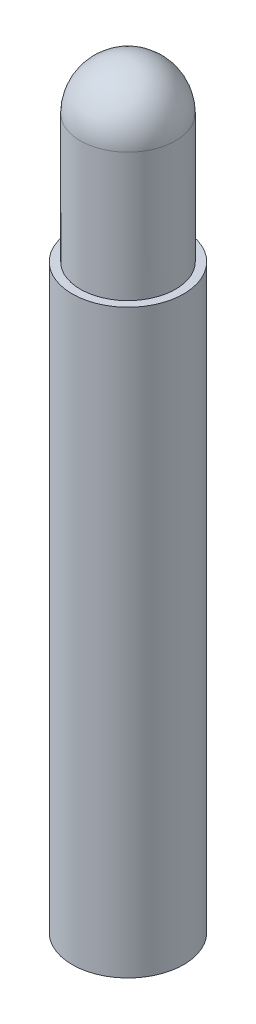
ISO-10303-21;
HEADER;
FILE_DESCRIPTION(('STEP AP214'),'2;1');
FILE_NAME('part.step','',(''),(''),'','','');
FILE_SCHEMA(('AUTOMOTIVE_DESIGN { 1 0 10303 214 1 1 1 1 }'));
ENDSEC;
DATA;
#1=APPLICATION_CONTEXT('core data for automotive mechanical design processes');
#2=APPLICATION_PROTOCOL_DEFINITION('international standard','automotive_design',2000,#1);
#3=PRODUCT_CONTEXT('',#1,'mechanical');
#4=PRODUCT('Part','Part','',(#3));
#5=PRODUCT_RELATED_PRODUCT_CATEGORY('part','',(#4));
#6=PRODUCT_DEFINITION_FORMATION('','',#4);
#7=PRODUCT_DEFINITION_CONTEXT('part definition',#1,'design');
#8=PRODUCT_DEFINITION('design','',#6,#7);
#9=PRODUCT_DEFINITION_SHAPE('','',#8);
#10=(LENGTH_UNIT() NAMED_UNIT(*) SI_UNIT(.MILLI.,.METRE.));
#11=(NAMED_UNIT(*) PLANE_ANGLE_UNIT() SI_UNIT($,.RADIAN.));
#12=(NAMED_UNIT(*) SI_UNIT($,.STERADIAN.) SOLID_ANGLE_UNIT());
#13=UNCERTAINTY_MEASURE_WITH_UNIT(LENGTH_MEASURE(1.E-05),#10,'distance_accuracy_value','');
#14=(GEOMETRIC_REPRESENTATION_CONTEXT(3) GLOBAL_UNCERTAINTY_ASSIGNED_CONTEXT((#13)) GLOBAL_UNIT_ASSIGNED_CONTEXT((#10,
#11,#12)) REPRESENTATION_CONTEXT('',''));
#15=CARTESIAN_POINT('',(0.,0.,0.));
#16=DIRECTION('',(0.,0.,1.));
#17=DIRECTION('',(1.,0.,0.));
#18=AXIS2_PLACEMENT_3D('',#15,#16,#17);
#19=CARTESIAN_POINT('',(0.,-31.2499999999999,0.));
#20=DIRECTION('',(0.,1.,0.));
#21=DIRECTION('',(-0.999589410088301,0.,-0.028653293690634));
#22=AXIS2_PLACEMENT_3D('',#19,#20,#21);
#23=CYLINDRICAL_SURFACE('',#22,5.85);
#24=CARTESIAN_POINT('',(0.,-31.2499999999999,0.));
#25=DIRECTION('',(0.,-1.,0.));
#26=DIRECTION('',(0.999589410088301,0.,0.028653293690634));
#27=AXIS2_PLACEMENT_3D('',#24,#25,#26);
#28=CIRCLE('',#27,5.85);
#29=CARTESIAN_POINT('',(-5.84759804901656,-31.2499999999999,-0.167621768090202));
#30=VERTEX_POINT('',#29);
#31=EDGE_CURVE('E9',#30,#30,#28,.T.);
#32=CARTESIAN_POINT('',(0.,29.7500000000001,0.));
#33=DIRECTION('',(0.,-1.,0.));
#34=DIRECTION('',(0.999589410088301,0.,0.028653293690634));
#35=AXIS2_PLACEMENT_3D('',#32,#33,#34);
#36=CIRCLE('',#35,5.85);
#37=CARTESIAN_POINT('',(-5.84759804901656,29.7500000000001,-0.167621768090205));
#38=VERTEX_POINT('',#37);
#39=EDGE_CURVE('E19',#38,#38,#36,.T.);
#40=CARTESIAN_POINT('',(-5.84759804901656,-31.2499999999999,-0.167621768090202));
#41=CARTESIAN_POINT('',(-5.84759804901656,-30.6145833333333,-0.167621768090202));
#42=CARTESIAN_POINT('',(-5.84759804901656,-29.9791666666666,-0.167621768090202));
#43=CARTESIAN_POINT('',(-5.84759804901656,-28.7083333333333,-0.167621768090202));
#44=CARTESIAN_POINT('',(-5.84759804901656,-28.0729166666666,-0.167621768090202));
#45=CARTESIAN_POINT('',(-5.84759804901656,-26.8020833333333,-0.167621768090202));
#46=CARTESIAN_POINT('',(-5.84759804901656,-26.1666666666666,-0.167621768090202));
#47=CARTESIAN_POINT('',(-5.84759804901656,-24.8958333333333,-0.167621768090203));
#48=CARTESIAN_POINT('',(-5.84759804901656,-24.2604166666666,-0.167621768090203));
#49=CARTESIAN_POINT('',(-5.84759804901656,-22.9895833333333,-0.167621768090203));
#50=CARTESIAN_POINT('',(-5.84759804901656,-22.3541666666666,-0.167621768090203));
#51=CARTESIAN_POINT('',(-5.84759804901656,-21.0833333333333,-0.167621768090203));
#52=CARTESIAN_POINT('',(-5.84759804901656,-20.4479166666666,-0.167621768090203));
#53=CARTESIAN_POINT('',(-5.84759804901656,-19.1770833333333,-0.167621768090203));
#54=CARTESIAN_POINT('',(-5.84759804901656,-18.5416666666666,-0.167621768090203));
#55=CARTESIAN_POINT('',(-5.84759804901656,-17.2708333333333,-0.167621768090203));
#56=CARTESIAN_POINT('',(-5.84759804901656,-16.6354166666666,-0.167621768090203));
#57=CARTESIAN_POINT('',(-5.84759804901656,-15.3645833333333,-0.167621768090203));
#58=CARTESIAN_POINT('',(-5.84759804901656,-14.7291666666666,-0.167621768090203));
#59=CARTESIAN_POINT('',(-5.84759804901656,-13.4583333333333,-0.167621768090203));
#60=CARTESIAN_POINT('',(-5.84759804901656,-12.8229166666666,-0.167621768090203));
#61=CARTESIAN_POINT('',(-5.84759804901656,-11.5520833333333,-0.167621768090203));
#62=CARTESIAN_POINT('',(-5.84759804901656,-10.9166666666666,-0.167621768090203));
#63=CARTESIAN_POINT('',(-5.84759804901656,-9.64583333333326,-0.167621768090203));
#64=CARTESIAN_POINT('',(-5.84759804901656,-9.01041666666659,-0.167621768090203));
#65=CARTESIAN_POINT('',(-5.84759804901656,-7.73958333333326,-0.167621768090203));
#66=CARTESIAN_POINT('',(-5.84759804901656,-7.1041666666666,-0.167621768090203));
#67=CARTESIAN_POINT('',(-5.84759804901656,-5.83333333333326,-0.167621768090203));
#68=CARTESIAN_POINT('',(-5.84759804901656,-5.1979166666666,-0.167621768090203));
#69=CARTESIAN_POINT('',(-5.84759804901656,-3.92708333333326,-0.167621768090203));
#70=CARTESIAN_POINT('',(-5.84759804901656,-3.29166666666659,-0.167621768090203));
#71=CARTESIAN_POINT('',(-5.84759804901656,-2.02083333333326,-0.167621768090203));
#72=CARTESIAN_POINT('',(-5.84759804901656,-1.38541666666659,-0.167621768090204));
#73=CARTESIAN_POINT('',(-5.84759804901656,-0.114583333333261,-0.167621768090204));
#74=CARTESIAN_POINT('',(-5.84759804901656,0.520833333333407,-0.167621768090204));
#75=CARTESIAN_POINT('',(-5.84759804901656,1.79166666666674,-0.167621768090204));
#76=CARTESIAN_POINT('',(-5.84759804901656,2.42708333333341,-0.167621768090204));
#77=CARTESIAN_POINT('',(-5.84759804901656,3.69791666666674,-0.167621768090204));
#78=CARTESIAN_POINT('',(-5.84759804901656,4.33333333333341,-0.167621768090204));
#79=CARTESIAN_POINT('',(-5.84759804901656,5.60416666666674,-0.167621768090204));
#80=CARTESIAN_POINT('',(-5.84759804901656,6.23958333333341,-0.167621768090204));
#81=CARTESIAN_POINT('',(-5.84759804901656,7.51041666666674,-0.167621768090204));
#82=CARTESIAN_POINT('',(-5.84759804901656,8.14583333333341,-0.167621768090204));
#83=CARTESIAN_POINT('',(-5.84759804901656,9.41666666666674,-0.167621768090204));
#84=CARTESIAN_POINT('',(-5.84759804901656,10.0520833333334,-0.167621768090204));
#85=CARTESIAN_POINT('',(-5.84759804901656,11.3229166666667,-0.167621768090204));
#86=CARTESIAN_POINT('',(-5.84759804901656,11.9583333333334,-0.167621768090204));
#87=CARTESIAN_POINT('',(-5.84759804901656,13.2291666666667,-0.167621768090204));
#88=CARTESIAN_POINT('',(-5.84759804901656,13.8645833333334,-0.167621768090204));
#89=CARTESIAN_POINT('',(-5.84759804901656,15.1354166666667,-0.167621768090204));
#90=CARTESIAN_POINT('',(-5.84759804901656,15.7708333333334,-0.167621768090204));
#91=CARTESIAN_POINT('',(-5.84759804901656,17.0416666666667,-0.167621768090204));
#92=CARTESIAN_POINT('',(-5.84759804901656,17.6770833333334,-0.167621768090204));
#93=CARTESIAN_POINT('',(-5.84759804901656,18.9479166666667,-0.167621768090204));
#94=CARTESIAN_POINT('',(-5.84759804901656,19.5833333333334,-0.167621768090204));
#95=CARTESIAN_POINT('',(-5.84759804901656,20.8541666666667,-0.167621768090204));
#96=CARTESIAN_POINT('',(-5.84759804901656,21.4895833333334,-0.167621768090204));
#97=CARTESIAN_POINT('',(-5.84759804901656,22.7604166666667,-0.167621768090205));
#98=CARTESIAN_POINT('',(-5.84759804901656,23.3958333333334,-0.167621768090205));
#99=CARTESIAN_POINT('',(-5.84759804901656,24.6666666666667,-0.167621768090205));
#100=CARTESIAN_POINT('',(-5.84759804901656,25.3020833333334,-0.167621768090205));
#101=CARTESIAN_POINT('',(-5.84759804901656,26.5729166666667,-0.167621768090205));
#102=CARTESIAN_POINT('',(-5.84759804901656,27.2083333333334,-0.167621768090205));
#103=CARTESIAN_POINT('',(-5.84759804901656,28.4791666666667,-0.167621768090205));
#104=CARTESIAN_POINT('',(-5.84759804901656,29.1145833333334,-0.167621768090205));
#105=CARTESIAN_POINT('',(-5.84759804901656,29.7500000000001,-0.167621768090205));
#106=B_SPLINE_CURVE_WITH_KNOTS('',3,(#40,#41,#42,#43,#44,#45,#46,#47,#48,#49,#50,#51,#52,#53,
#54,#55,#56,#57,#58,#59,#60,#61,#62,#63,#64,#65,#66,#67,#68,#69,#70,#71,#72,#73,#74,#75,#76,#77,
#78,#79,#80,#81,#82,#83,#84,#85,#86,#87,#88,#89,#90,#91,#92,#93,#94,#95,#96,#97,#98,#99,#100,
#101,#102,#103,#104,#105),.UNSPECIFIED.,.F.,.F.,(4,2,2,2,2,2,2,2,2,2,2,2,2,2,2,2,2,2,2,2,2,2,2,
2,2,2,2,2,2,2,2,2,4),(0.,1.90625,3.8125,5.71875,7.625,9.53125,11.4375,13.34375,15.25,17.15625,
19.0625,20.96875,22.875,24.78125,26.6875,28.59375,30.5,32.40625,34.3125,36.21875,38.125,
40.03125,41.9375,43.84375,45.75,47.65625,49.5625,51.46875,53.375,55.28125,57.1875,59.09375,61.),.UNSPECIFIED.);
#107=EDGE_CURVE('BSEAM13',#30,#38,#106,.T.);
#108=ORIENTED_EDGE('',*,*,#31,.F.);
#109=ORIENTED_EDGE('',*,*,#39,.T.);
#110=ORIENTED_EDGE('',*,*,#107,.T.);
#111=ORIENTED_EDGE('',*,*,#107,.F.);
#112=EDGE_LOOP('',(#108,#110,#109,#111));
#113=FACE_BOUND('',#112,.T.);
#114=ADVANCED_FACE('F13',(#113),#23,.T.);
#115=CARTESIAN_POINT('',(0.,-31.2499999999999,0.));
#116=DIRECTION('',(0.,-1.,0.));
#117=DIRECTION('',(0.999589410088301,0.,0.028653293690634));
#118=AXIS2_PLACEMENT_3D('',#115,#116,#117);
#119=PLANE('',#118);
#120=ORIENTED_EDGE('',*,*,#31,.T.);
#121=EDGE_LOOP('',(#120));
#122=FACE_BOUND('',#121,.T.);
#123=ADVANCED_FACE('F47',(#122),#119,.T.);
#124=CARTESIAN_POINT('',(0.,29.7500000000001,0.));
#125=DIRECTION('',(0.,-1.,0.));
#126=DIRECTION('',(0.999589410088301,0.,0.028653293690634));
#127=AXIS2_PLACEMENT_3D('',#124,#125,#126);
#128=PLANE('',#127);
#129=CARTESIAN_POINT('',(0.,29.7500000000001,0.));
#130=DIRECTION('',(0.,-1.,0.));
#131=DIRECTION('',(-0.440625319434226,0.,-0.89769110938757));
#132=AXIS2_PLACEMENT_3D('',#129,#130,#131);
#133=CIRCLE('',#132,5.);
#134=CARTESIAN_POINT('',(-2.20312659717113,29.7500000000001,-4.48845554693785));
#135=VERTEX_POINT('',#134);
#136=EDGE_CURVE('E23',#135,#135,#133,.T.);
#137=ORIENTED_EDGE('',*,*,#136,.T.);
#138=EDGE_LOOP('',(#137));
#139=FACE_BOUND('',#138,.T.);
#140=ORIENTED_EDGE('',*,*,#39,.F.);
#141=EDGE_LOOP('',(#140));
#142=FACE_BOUND('',#141,.T.);
#143=ADVANCED_FACE('F44',(#139,#142),#128,.F.);
#144=CARTESIAN_POINT('',(0.,23.7500000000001,0.));
#145=DIRECTION('',(0.,-1.,0.));
#146=DIRECTION('',(-0.440625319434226,0.,-0.89769110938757));
#147=AXIS2_PLACEMENT_3D('',#144,#145,#146);
#148=CYLINDRICAL_SURFACE('',#147,5.);
#149=CARTESIAN_POINT('',(0.,43.2500000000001,0.));
#150=DIRECTION('',(0.,-1.,0.));
#151=DIRECTION('',(-0.440625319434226,0.,-0.89769110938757));
#152=AXIS2_PLACEMENT_3D('',#149,#150,#151);
#153=CIRCLE('',#152,5.);
#154=CARTESIAN_POINT('',(-2.20312659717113,43.2500000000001,-4.48845554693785));
#155=VERTEX_POINT('',#154);
#156=EDGE_CURVE('E27',#155,#155,#153,.T.);
#157=ORIENTED_EDGE('',*,*,#156,.T.);
#158=EDGE_LOOP('',(#157));
#159=FACE_BOUND('',#158,.T.);
#160=ORIENTED_EDGE('',*,*,#136,.F.);
#161=EDGE_LOOP('',(#160));
#162=FACE_BOUND('',#161,.T.);
#163=ADVANCED_FACE('F33',(#159,#162),#148,.T.);
#164=CARTESIAN_POINT('',(0.,43.2500000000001,0.));
#165=DIRECTION('',(0.,-1.,0.));
#166=DIRECTION('',(0.89769110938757,0.,-0.440625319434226));
#167=AXIS2_PLACEMENT_3D('',#164,#165,#166);
#168=SPHERICAL_SURFACE('',#167,5.);
#169=ORIENTED_EDGE('',*,*,#156,.F.);
#170=EDGE_LOOP('',(#169));
#171=FACE_BOUND('',#170,.T.);
#172=ADVANCED_FACE('F36',(#171),#168,.T.);
#173=CLOSED_SHELL('',(#114,#123,#143,#163,#172));
#174=MANIFOLD_SOLID_BREP('B1',#173);
#175=ADVANCED_BREP_SHAPE_REPRESENTATION('',(#18,#174),#14);
#176=SHAPE_DEFINITION_REPRESENTATION(#9,#175);
ENDSEC;
END-ISO-10303-21;
